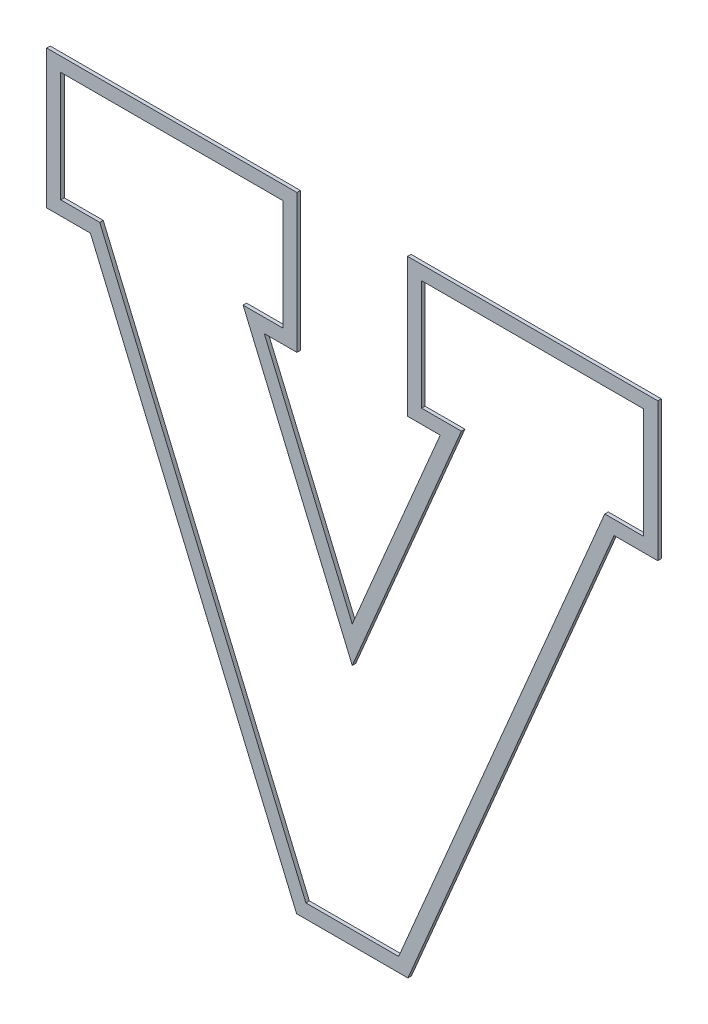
from build123d import *

# Parameters (mm, degrees)
BOSS_EXTRUDE1_DEPTH = 3.175


with BuildPart() as part:
    # Sketch1 → Boss-Extrude1 (new body)
    with BuildSketch(Plane.XY):
        Polygon((326.57540387, 440.106030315), (356.125130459, 440.106030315), (276.517141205, 252.324832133), (196.90915195, 440.106030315), (226.458878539, 440.106030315), (226.458878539, 565.45437456), (0, 565.45437456), (0, 440.106030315), (39.559160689, 440.106030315), (226.137777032, 0), (326.896505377, 0), (513.47512172, 440.106030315), (553.034282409, 440.106030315), (553.034282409, 565.45437456), (326.57540387, 565.45437456), align=None)
        Polygon((318.486420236, 12.7), (234.547862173, 12.7), (47.96924583, 452.806030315), (12.7, 452.806030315), (12.7, 552.75437456), (213.758878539, 552.75437456), (213.758878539, 452.806030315), (177.730987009, 452.806030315), (276.517141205, 219.786925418), (375.3032954, 452.806030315), (339.27540387, 452.806030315), (339.27540387, 552.75437456), (540.334282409, 552.75437456), (540.334282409, 452.806030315), (505.065036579, 452.806030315), align=None, mode=Mode.SUBTRACT)
    extrude(amount=BOSS_EXTRUDE1_DEPTH)


solid = part.part
